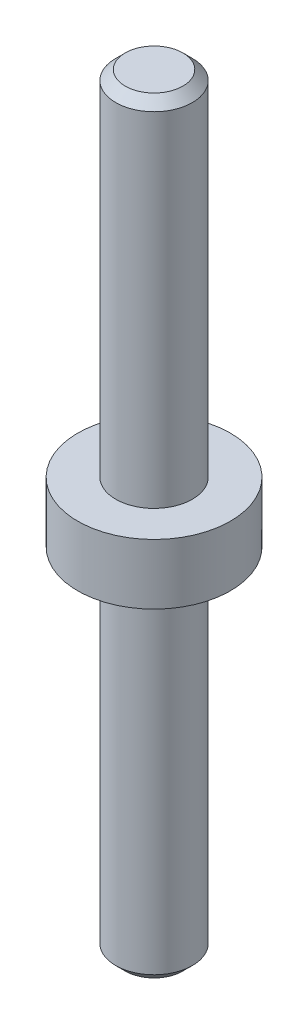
ISO-10303-21;
HEADER;
FILE_DESCRIPTION(('STEP AP214'),'2;1');
FILE_NAME('part.step','',(''),(''),'','','');
FILE_SCHEMA(('AUTOMOTIVE_DESIGN { 1 0 10303 214 1 1 1 1 }'));
ENDSEC;
DATA;
#1=APPLICATION_CONTEXT('core data for automotive mechanical design processes');
#2=APPLICATION_PROTOCOL_DEFINITION('international standard','automotive_design',2000,#1);
#3=PRODUCT_CONTEXT('',#1,'mechanical');
#4=PRODUCT('Part','Part','',(#3));
#5=PRODUCT_RELATED_PRODUCT_CATEGORY('part','',(#4));
#6=PRODUCT_DEFINITION_FORMATION('','',#4);
#7=PRODUCT_DEFINITION_CONTEXT('part definition',#1,'design');
#8=PRODUCT_DEFINITION('design','',#6,#7);
#9=PRODUCT_DEFINITION_SHAPE('','',#8);
#10=(LENGTH_UNIT() NAMED_UNIT(*) SI_UNIT(.MILLI.,.METRE.));
#11=(NAMED_UNIT(*) PLANE_ANGLE_UNIT() SI_UNIT($,.RADIAN.));
#12=(NAMED_UNIT(*) SI_UNIT($,.STERADIAN.) SOLID_ANGLE_UNIT());
#13=UNCERTAINTY_MEASURE_WITH_UNIT(LENGTH_MEASURE(1.E-05),#10,'distance_accuracy_value','');
#14=(GEOMETRIC_REPRESENTATION_CONTEXT(3) GLOBAL_UNCERTAINTY_ASSIGNED_CONTEXT((#13)) GLOBAL_UNIT_ASSIGNED_CONTEXT((#10,
#11,#12)) REPRESENTATION_CONTEXT('',''));
#15=CARTESIAN_POINT('',(0.,0.,0.));
#16=DIRECTION('',(0.,0.,1.));
#17=DIRECTION('',(1.,0.,0.));
#18=AXIS2_PLACEMENT_3D('',#15,#16,#17);
#19=CARTESIAN_POINT('',(0.,31.75,0.));
#20=DIRECTION('',(0.,-1.,0.));
#21=DIRECTION('',(0.,0.,-1.));
#22=AXIS2_PLACEMENT_3D('',#19,#20,#21);
#23=CYLINDRICAL_SURFACE('',#22,3.17499999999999);
#24=CARTESIAN_POINT('',(0.,-30.9626,0.));
#25=DIRECTION('',(0.,-1.,0.));
#26=DIRECTION('',(0.,0.,-1.));
#27=AXIS2_PLACEMENT_3D('',#24,#25,#26);
#28=CIRCLE('',#27,3.17499999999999);
#29=CARTESIAN_POINT('',(0.,-30.9626,-3.17499999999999));
#30=VERTEX_POINT('',#29);
#31=EDGE_CURVE('E54',#30,#30,#28,.T.);
#32=ORIENTED_EDGE('',*,*,#31,.F.);
#33=EDGE_LOOP('',(#32));
#34=FACE_BOUND('',#33,.T.);
#35=CARTESIAN_POINT('',(0.,-2.5,0.));
#36=DIRECTION('',(0.,1.,0.));
#37=DIRECTION('',(0.,0.,1.));
#38=AXIS2_PLACEMENT_3D('',#35,#36,#37);
#39=CIRCLE('',#38,3.17499999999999);
#40=CARTESIAN_POINT('',(0.,-2.5,3.17499999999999));
#41=VERTEX_POINT('',#40);
#42=EDGE_CURVE('E10',#41,#41,#39,.T.);
#43=ORIENTED_EDGE('',*,*,#42,.F.);
#44=EDGE_LOOP('',(#43));
#45=FACE_BOUND('',#44,.T.);
#46=ADVANCED_FACE('F31',(#34,#45),#23,.T.);
#47=CARTESIAN_POINT('',(0.,-31.75,0.));
#48=DIRECTION('',(0.,1.,0.));
#49=DIRECTION('',(0.,0.,-1.));
#50=AXIS2_PLACEMENT_3D('',#47,#48,#49);
#51=PLANE('',#50);
#52=CARTESIAN_POINT('',(0.,-31.75,0.));
#53=DIRECTION('',(0.,-1.,0.));
#54=DIRECTION('',(0.,0.,-1.));
#55=AXIS2_PLACEMENT_3D('',#52,#53,#54);
#56=CIRCLE('',#55,2.3876);
#57=CARTESIAN_POINT('',(0.,-31.75,-2.3876));
#58=VERTEX_POINT('',#57);
#59=EDGE_CURVE('E51',#58,#58,#56,.F.);
#60=ORIENTED_EDGE('',*,*,#59,.F.);
#61=EDGE_LOOP('',(#60));
#62=FACE_BOUND('',#61,.T.);
#63=ADVANCED_FACE('F79',(#62),#51,.F.);
#64=CARTESIAN_POINT('',(0.,-30.9626,0.));
#65=DIRECTION('',(0.,1.,0.));
#66=DIRECTION('',(0.,0.,-1.));
#67=AXIS2_PLACEMENT_3D('',#64,#65,#66);
#68=CONICAL_SURFACE('',#67,3.17499999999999,0.785398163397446);
#69=ORIENTED_EDGE('',*,*,#59,.T.);
#70=EDGE_LOOP('',(#69));
#71=FACE_BOUND('',#70,.T.);
#72=ORIENTED_EDGE('',*,*,#31,.T.);
#73=EDGE_LOOP('',(#72));
#74=FACE_BOUND('',#73,.T.);
#75=ADVANCED_FACE('F85',(#71,#74),#68,.T.);
#76=CARTESIAN_POINT('',(-3.17499999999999,-2.5,0.));
#77=DIRECTION('',(0.,1.,0.));
#78=DIRECTION('',(0.,0.,1.));
#79=AXIS2_PLACEMENT_3D('',#76,#77,#78);
#80=PLANE('',#79);
#81=ORIENTED_EDGE('',*,*,#42,.T.);
#82=EDGE_LOOP('',(#81));
#83=FACE_BOUND('',#82,.T.);
#84=CARTESIAN_POINT('',(0.,-2.5,0.));
#85=DIRECTION('',(0.,-1.,0.));
#86=DIRECTION('',(0.,0.,-1.));
#87=AXIS2_PLACEMENT_3D('',#84,#85,#86);
#88=CIRCLE('',#87,6.32500005);
#89=CARTESIAN_POINT('',(0.,-2.5,-6.32500005));
#90=VERTEX_POINT('',#89);
#91=EDGE_CURVE('E57',#90,#90,#88,.T.);
#92=ORIENTED_EDGE('',*,*,#91,.T.);
#93=EDGE_LOOP('',(#92));
#94=FACE_BOUND('',#93,.T.);
#95=ADVANCED_FACE('F75',(#83,#94),#80,.F.);
#96=CARTESIAN_POINT('',(0.,0.,0.));
#97=DIRECTION('',(0.,-1.,0.));
#98=DIRECTION('',(0.,0.,-1.));
#99=AXIS2_PLACEMENT_3D('',#96,#97,#98);
#100=CYLINDRICAL_SURFACE('',#99,6.32500005);
#101=ORIENTED_EDGE('',*,*,#91,.F.);
#102=EDGE_LOOP('',(#101));
#103=FACE_BOUND('',#102,.T.);
#104=CARTESIAN_POINT('',(0.,2.5,0.));
#105=DIRECTION('',(0.,-1.,0.));
#106=DIRECTION('',(0.,0.,-1.));
#107=AXIS2_PLACEMENT_3D('',#104,#105,#106);
#108=CIRCLE('',#107,6.32500005);
#109=CARTESIAN_POINT('',(0.,2.5,-6.32500005));
#110=VERTEX_POINT('',#109);
#111=EDGE_CURVE('E60',#110,#110,#108,.T.);
#112=ORIENTED_EDGE('',*,*,#111,.T.);
#113=EDGE_LOOP('',(#112));
#114=FACE_BOUND('',#113,.T.);
#115=ADVANCED_FACE('F64',(#103,#114),#100,.T.);
#116=CARTESIAN_POINT('',(-3.17499999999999,2.5,0.));
#117=DIRECTION('',(0.,-1.,0.));
#118=DIRECTION('',(0.,0.,-1.));
#119=AXIS2_PLACEMENT_3D('',#116,#117,#118);
#120=PLANE('',#119);
#121=ORIENTED_EDGE('',*,*,#111,.F.);
#122=EDGE_LOOP('',(#121));
#123=FACE_BOUND('',#122,.T.);
#124=CARTESIAN_POINT('',(0.,2.5,0.));
#125=DIRECTION('',(0.,-1.,0.));
#126=DIRECTION('',(0.,0.,-1.));
#127=AXIS2_PLACEMENT_3D('',#124,#125,#126);
#128=CIRCLE('',#127,3.17499999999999);
#129=CARTESIAN_POINT('',(0.,2.5,-3.17499999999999));
#130=VERTEX_POINT('',#129);
#131=EDGE_CURVE('E38',#130,#130,#128,.T.);
#132=ORIENTED_EDGE('',*,*,#131,.T.);
#133=EDGE_LOOP('',(#132));
#134=FACE_BOUND('',#133,.T.);
#135=ADVANCED_FACE('F66',(#123,#134),#120,.F.);
#136=CARTESIAN_POINT('',(0.,31.75,0.));
#137=DIRECTION('',(0.,-1.,0.));
#138=DIRECTION('',(0.,0.,-1.));
#139=AXIS2_PLACEMENT_3D('',#136,#137,#138);
#140=PLANE('',#139);
#141=CARTESIAN_POINT('',(0.,31.75,0.));
#142=DIRECTION('',(0.,-1.,0.));
#143=DIRECTION('',(0.,0.,-1.));
#144=AXIS2_PLACEMENT_3D('',#141,#142,#143);
#145=CIRCLE('',#144,2.3876);
#146=CARTESIAN_POINT('',(0.,31.75,-2.3876));
#147=VERTEX_POINT('',#146);
#148=EDGE_CURVE('E42',#147,#147,#145,.F.);
#149=ORIENTED_EDGE('',*,*,#148,.T.);
#150=EDGE_LOOP('',(#149));
#151=FACE_BOUND('',#150,.T.);
#152=ADVANCED_FACE('F33',(#151),#140,.F.);
#153=CARTESIAN_POINT('',(0.,30.9626,0.));
#154=DIRECTION('',(0.,-1.,0.));
#155=DIRECTION('',(0.,0.,-1.));
#156=AXIS2_PLACEMENT_3D('',#153,#154,#155);
#157=CONICAL_SURFACE('',#156,3.17499999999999,0.785398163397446);
#158=ORIENTED_EDGE('',*,*,#148,.F.);
#159=EDGE_LOOP('',(#158));
#160=FACE_BOUND('',#159,.T.);
#161=CARTESIAN_POINT('',(0.,30.9626,0.));
#162=DIRECTION('',(0.,-1.,0.));
#163=DIRECTION('',(0.,0.,-1.));
#164=AXIS2_PLACEMENT_3D('',#161,#162,#163);
#165=CIRCLE('',#164,3.17499999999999);
#166=CARTESIAN_POINT('',(0.,30.9626,-3.17499999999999));
#167=VERTEX_POINT('',#166);
#168=EDGE_CURVE('E46',#167,#167,#165,.T.);
#169=ORIENTED_EDGE('',*,*,#168,.F.);
#170=EDGE_LOOP('',(#169));
#171=FACE_BOUND('',#170,.T.);
#172=ADVANCED_FACE('F73',(#160,#171),#157,.T.);
#173=ORIENTED_EDGE('',*,*,#168,.T.);
#174=EDGE_LOOP('',(#173));
#175=FACE_BOUND('',#174,.T.);
#176=ORIENTED_EDGE('',*,*,#131,.F.);
#177=EDGE_LOOP('',(#176));
#178=FACE_BOUND('',#177,.T.);
#179=ADVANCED_FACE('F81',(#175,#178),#23,.T.);
#180=CLOSED_SHELL('',(#46,#63,#75,#95,#115,#135,#152,#172,#179));
#181=MANIFOLD_SOLID_BREP('B2',#180);
#182=ADVANCED_BREP_SHAPE_REPRESENTATION('',(#18,#181),#14);
#183=SHAPE_DEFINITION_REPRESENTATION(#9,#182);
ENDSEC;
END-ISO-10303-21;
